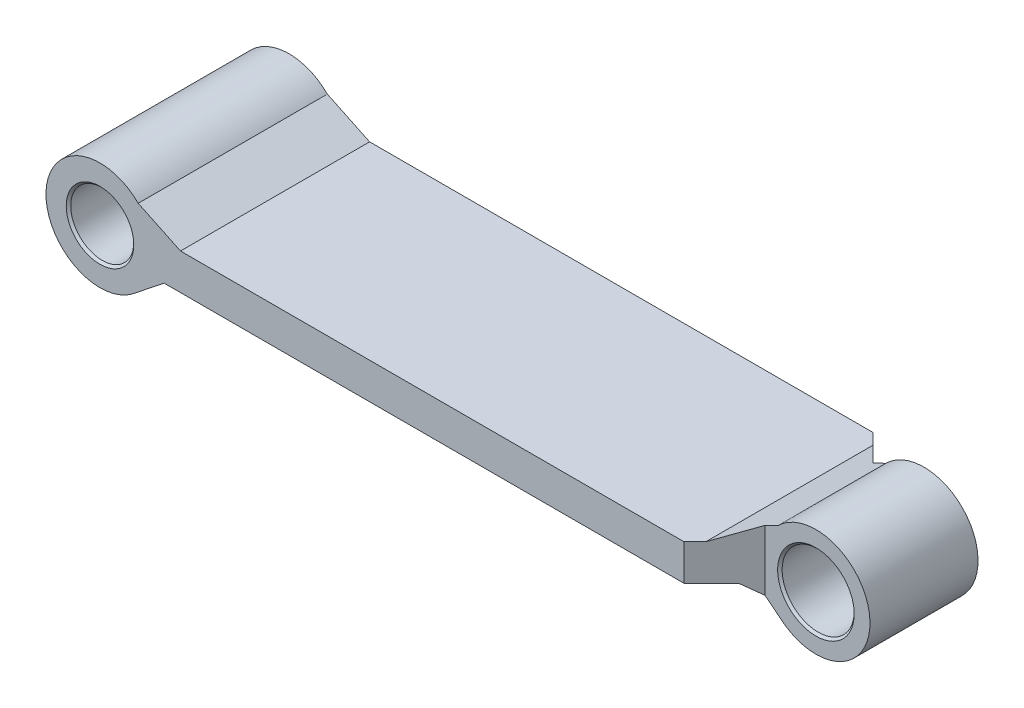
ISO-10303-21;
HEADER;
FILE_DESCRIPTION(('STEP AP214'),'2;1');
FILE_NAME('part.step','',(''),(''),'','','');
FILE_SCHEMA(('AUTOMOTIVE_DESIGN { 1 0 10303 214 1 1 1 1 }'));
ENDSEC;
DATA;
#1=APPLICATION_CONTEXT('core data for automotive mechanical design processes');
#2=APPLICATION_PROTOCOL_DEFINITION('international standard','automotive_design',2000,#1);
#3=PRODUCT_CONTEXT('',#1,'mechanical');
#4=PRODUCT('Part','Part','',(#3));
#5=PRODUCT_RELATED_PRODUCT_CATEGORY('part','',(#4));
#6=PRODUCT_DEFINITION_FORMATION('','',#4);
#7=PRODUCT_DEFINITION_CONTEXT('part definition',#1,'design');
#8=PRODUCT_DEFINITION('design','',#6,#7);
#9=PRODUCT_DEFINITION_SHAPE('','',#8);
#10=(LENGTH_UNIT() NAMED_UNIT(*) SI_UNIT(.MILLI.,.METRE.));
#11=(NAMED_UNIT(*) PLANE_ANGLE_UNIT() SI_UNIT($,.RADIAN.));
#12=(NAMED_UNIT(*) SI_UNIT($,.STERADIAN.) SOLID_ANGLE_UNIT());
#13=UNCERTAINTY_MEASURE_WITH_UNIT(LENGTH_MEASURE(1.E-05),#10,'distance_accuracy_value','');
#14=(GEOMETRIC_REPRESENTATION_CONTEXT(3) GLOBAL_UNCERTAINTY_ASSIGNED_CONTEXT((#13)) GLOBAL_UNIT_ASSIGNED_CONTEXT((#10,
#11,#12)) REPRESENTATION_CONTEXT('',''));
#15=CARTESIAN_POINT('',(0.,0.,0.));
#16=DIRECTION('',(0.,0.,1.));
#17=DIRECTION('',(1.,0.,0.));
#18=AXIS2_PLACEMENT_3D('',#15,#16,#17);
#19=CARTESIAN_POINT('',(-37.5,4.,10.5));
#20=DIRECTION('',(0.,0.,-1.));
#21=DIRECTION('',(-1.,0.,0.));
#22=AXIS2_PLACEMENT_3D('',#19,#20,#21);
#23=PLANE('',#22);
#24=CARTESIAN_POINT('',(-37.5000000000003,2.,10.5));
#25=DIRECTION('',(0.,0.,-1.));
#26=DIRECTION('',(-1.,0.,0.));
#27=AXIS2_PLACEMENT_3D('',#24,#25,#26);
#28=CIRCLE('',#27,3.75000000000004);
#29=CARTESIAN_POINT('',(-41.2500000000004,2.,10.5));
#30=VERTEX_POINT('',#29);
#31=EDGE_CURVE('E192',#30,#30,#28,.T.);
#32=ORIENTED_EDGE('',*,*,#31,.T.);
#33=EDGE_LOOP('',(#32));
#34=FACE_BOUND('',#33,.T.);
#35=CARTESIAN_POINT('',(-37.5000000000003,2.,10.5));
#36=DIRECTION('',(0.,0.,1.));
#37=DIRECTION('',(1.,0.,0.));
#38=AXIS2_PLACEMENT_3D('',#35,#36,#37);
#39=CIRCLE('',#38,6.);
#40=CARTESIAN_POINT('',(-33.257359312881,6.24264068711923,10.5));
#41=VERTEX_POINT('',#40);
#42=CARTESIAN_POINT('',(-33.5880266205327,-2.54933668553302,10.5));
#43=VERTEX_POINT('',#42);
#44=EDGE_CURVE('E276',#41,#43,#39,.T.);
#45=ORIENTED_EDGE('',*,*,#44,.T.);
#46=DIRECTION('',(-0.783018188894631,-0.621998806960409,0.));
#47=VECTOR('',#46,1.);
#48=CARTESIAN_POINT('',(-32.796760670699,-1.92078618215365,10.5));
#49=LINE('',#48,#47);
#50=CARTESIAN_POINT('',(-30.3787326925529,0.,10.5));
#51=VERTEX_POINT('',#50);
#52=EDGE_CURVE('E244',#43,#51,#49,.F.);
#53=ORIENTED_EDGE('',*,*,#52,.T.);
#54=DIRECTION('',(1.,0.,0.));
#55=VECTOR('',#54,1.);
#56=CARTESIAN_POINT('',(-37.5,0.,10.5));
#57=LINE('',#56,#55);
#58=CARTESIAN_POINT('',(27.3431457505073,0.,10.5));
#59=VERTEX_POINT('',#58);
#60=EDGE_CURVE('E157',#51,#59,#57,.T.);
#61=ORIENTED_EDGE('',*,*,#60,.T.);
#62=DIRECTION('',(0.,1.,0.));
#63=VECTOR('',#62,1.);
#64=CARTESIAN_POINT('',(27.3431457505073,4.00000000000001,10.5));
#65=LINE('',#64,#63);
#66=CARTESIAN_POINT('',(27.3431457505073,4.,10.5));
#67=VERTEX_POINT('',#66);
#68=EDGE_CURVE('E149',#59,#67,#65,.T.);
#69=ORIENTED_EDGE('',*,*,#68,.T.);
#70=DIRECTION('',(1.,0.,0.));
#71=VECTOR('',#70,1.);
#72=CARTESIAN_POINT('',(-37.5,4.,10.5));
#73=LINE('',#72,#71);
#74=CARTESIAN_POINT('',(-28.5616367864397,4.,10.5));
#75=VERTEX_POINT('',#74);
#76=EDGE_CURVE('E130',#75,#67,#73,.T.);
#77=ORIENTED_EDGE('',*,*,#76,.F.);
#78=DIRECTION('',(0.902368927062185,-0.430964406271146,0.));
#79=VECTOR('',#78,1.);
#80=CARTESIAN_POINT('',(-35.839874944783,7.47603013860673,10.5));
#81=LINE('',#80,#79);
#82=EDGE_CURVE('E224',#75,#41,#81,.F.);
#83=ORIENTED_EDGE('',*,*,#82,.T.);
#84=EDGE_LOOP('',(#45,#53,#61,#69,#77,#83));
#85=FACE_BOUND('',#84,.T.);
#86=ADVANCED_FACE('F40',(#34,#85),#23,.F.);
#87=CARTESIAN_POINT('',(37.4999999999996,2.,10.5));
#88=DIRECTION('',(0.,0.,-1.));
#89=DIRECTION('',(-1.,0.,0.));
#90=AXIS2_PLACEMENT_3D('',#87,#88,#89);
#91=CYLINDRICAL_SURFACE('',#90,6.);
#92=CARTESIAN_POINT('',(37.4999999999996,2.,5.99999999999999));
#93=DIRECTION('',(0.,0.,1.));
#94=DIRECTION('',(1.,0.,0.));
#95=AXIS2_PLACEMENT_3D('',#92,#93,#94);
#96=CIRCLE('',#95,6.);
#97=CARTESIAN_POINT('',(33.588026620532,-2.54933668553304,5.99999999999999));
#98=VERTEX_POINT('',#97);
#99=CARTESIAN_POINT('',(33.2573593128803,6.24264068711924,5.99999999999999));
#100=VERTEX_POINT('',#99);
#101=EDGE_CURVE('E263',#98,#100,#96,.T.);
#102=ORIENTED_EDGE('',*,*,#101,.F.);
#103=DIRECTION('',(0.,0.,-1.));
#104=VECTOR('',#103,1.);
#105=CARTESIAN_POINT('',(33.588026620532,-2.54933668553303,10.5));
#106=LINE('',#105,#104);
#107=CARTESIAN_POINT('',(33.588026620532,-2.54933668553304,-6.00000000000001));
#108=VERTEX_POINT('',#107);
#109=EDGE_CURVE('E240',#98,#108,#106,.T.);
#110=ORIENTED_EDGE('',*,*,#109,.T.);
#111=CARTESIAN_POINT('',(37.4999999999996,2.,-6.00000000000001));
#112=DIRECTION('',(0.,0.,1.));
#113=DIRECTION('',(1.,0.,0.));
#114=AXIS2_PLACEMENT_3D('',#111,#112,#113);
#115=CIRCLE('',#114,6.);
#116=CARTESIAN_POINT('',(33.2573593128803,6.24264068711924,-6.00000000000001));
#117=VERTEX_POINT('',#116);
#118=EDGE_CURVE('E271',#108,#117,#115,.T.);
#119=ORIENTED_EDGE('',*,*,#118,.T.);
#120=DIRECTION('',(0.,0.,-1.));
#121=VECTOR('',#120,1.);
#122=CARTESIAN_POINT('',(33.2573593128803,6.24264068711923,10.5));
#123=LINE('',#122,#121);
#124=EDGE_CURVE('E205',#117,#100,#123,.F.);
#125=ORIENTED_EDGE('',*,*,#124,.T.);
#126=EDGE_LOOP('',(#102,#110,#119,#125));
#127=FACE_BOUND('',#126,.T.);
#128=ADVANCED_FACE('F265',(#127),#91,.T.);
#129=CARTESIAN_POINT('',(0.,4.,0.));
#130=DIRECTION('',(0.,1.,0.));
#131=DIRECTION('',(0.,0.,1.));
#132=AXIS2_PLACEMENT_3D('',#129,#130,#131);
#133=PLANE('',#132);
#134=DIRECTION('',(0.707106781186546,0.,-0.707106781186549));
#135=VECTOR('',#134,1.);
#136=CARTESIAN_POINT('',(18.9215728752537,4.,18.9215728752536));
#137=LINE('',#136,#135);
#138=CARTESIAN_POINT('',(28.561636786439,4.,9.28150896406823));
#139=VERTEX_POINT('',#138);
#140=EDGE_CURVE('E134',#67,#139,#137,.T.);
#141=ORIENTED_EDGE('',*,*,#140,.T.);
#142=DIRECTION('',(0.,0.,-1.));
#143=VECTOR('',#142,1.);
#144=CARTESIAN_POINT('',(28.561636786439,4.,0.));
#145=LINE('',#144,#143);
#146=CARTESIAN_POINT('',(28.5616367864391,4.,-9.28150896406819));
#147=VERTEX_POINT('',#146);
#148=EDGE_CURVE('E202',#139,#147,#145,.T.);
#149=ORIENTED_EDGE('',*,*,#148,.T.);
#150=DIRECTION('',(-0.707106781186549,0.,-0.707106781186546));
#151=VECTOR('',#150,1.);
#152=CARTESIAN_POINT('',(18.9215728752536,4.,-18.9215728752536));
#153=LINE('',#152,#151);
#154=CARTESIAN_POINT('',(27.3431457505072,4.,-10.5));
#155=VERTEX_POINT('',#154);
#156=EDGE_CURVE('E153',#147,#155,#153,.T.);
#157=ORIENTED_EDGE('',*,*,#156,.T.);
#158=DIRECTION('',(1.,0.,0.));
#159=VECTOR('',#158,1.);
#160=CARTESIAN_POINT('',(-37.5,4.,-10.5));
#161=LINE('',#160,#159);
#162=CARTESIAN_POINT('',(-28.5616367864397,4.,-10.5));
#163=VERTEX_POINT('',#162);
#164=EDGE_CURVE('E142',#163,#155,#161,.T.);
#165=ORIENTED_EDGE('',*,*,#164,.F.);
#166=DIRECTION('',(0.,0.,1.));
#167=VECTOR('',#166,1.);
#168=CARTESIAN_POINT('',(-28.5616367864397,4.,0.));
#169=LINE('',#168,#167);
#170=EDGE_CURVE('E138',#163,#75,#169,.T.);
#171=ORIENTED_EDGE('',*,*,#170,.T.);
#172=ORIENTED_EDGE('',*,*,#76,.T.);
#173=EDGE_LOOP('',(#141,#149,#157,#165,#171,#172));
#174=FACE_BOUND('',#173,.T.);
#175=ADVANCED_FACE('F132',(#174),#133,.T.);
#176=CARTESIAN_POINT('',(0.,0.,0.));
#177=DIRECTION('',(0.,1.,0.));
#178=DIRECTION('',(0.,0.,1.));
#179=AXIS2_PLACEMENT_3D('',#176,#177,#178);
#180=PLANE('',#179);
#181=ORIENTED_EDGE('',*,*,#60,.F.);
#182=DIRECTION('',(0.,0.,-1.));
#183=VECTOR('',#182,1.);
#184=CARTESIAN_POINT('',(-30.3787326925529,0.,-10.5));
#185=LINE('',#184,#183);
#186=CARTESIAN_POINT('',(-30.3787326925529,0.,-10.5));
#187=VERTEX_POINT('',#186);
#188=EDGE_CURVE('E237',#51,#187,#185,.T.);
#189=ORIENTED_EDGE('',*,*,#188,.T.);
#190=DIRECTION('',(1.,0.,0.));
#191=VECTOR('',#190,1.);
#192=CARTESIAN_POINT('',(-37.5,0.,-10.5));
#193=LINE('',#192,#191);
#194=CARTESIAN_POINT('',(27.3431457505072,0.,-10.5));
#195=VERTEX_POINT('',#194);
#196=EDGE_CURVE('E143',#187,#195,#193,.T.);
#197=ORIENTED_EDGE('',*,*,#196,.T.);
#198=DIRECTION('',(0.707106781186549,0.,0.707106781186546));
#199=VECTOR('',#198,1.);
#200=CARTESIAN_POINT('',(31.8431457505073,0.,-5.99999999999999));
#201=LINE('',#200,#199);
#202=CARTESIAN_POINT('',(30.3787326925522,0.,-7.46441305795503));
#203=VERTEX_POINT('',#202);
#204=EDGE_CURVE('E161',#195,#203,#201,.T.);
#205=ORIENTED_EDGE('',*,*,#204,.T.);
#206=DIRECTION('',(0.,0.,1.));
#207=VECTOR('',#206,1.);
#208=CARTESIAN_POINT('',(30.3787326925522,0.,5.99999999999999));
#209=LINE('',#208,#207);
#210=CARTESIAN_POINT('',(30.3787326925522,0.,7.46441305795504));
#211=VERTEX_POINT('',#210);
#212=EDGE_CURVE('E234',#203,#211,#209,.T.);
#213=ORIENTED_EDGE('',*,*,#212,.T.);
#214=DIRECTION('',(-0.707106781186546,0.,0.707106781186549));
#215=VECTOR('',#214,1.);
#216=CARTESIAN_POINT('',(27.3431457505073,0.,10.5));
#217=LINE('',#216,#215);
#218=EDGE_CURVE('E169',#211,#59,#217,.T.);
#219=ORIENTED_EDGE('',*,*,#218,.T.);
#220=EDGE_LOOP('',(#181,#189,#197,#205,#213,#219));
#221=FACE_BOUND('',#220,.T.);
#222=ADVANCED_FACE('F297',(#221),#180,.F.);
#223=CARTESIAN_POINT('',(-37.5,4.,-10.5));
#224=DIRECTION('',(0.,0.,-1.));
#225=DIRECTION('',(-1.,0.,0.));
#226=AXIS2_PLACEMENT_3D('',#223,#224,#225);
#227=PLANE('',#226);
#228=CARTESIAN_POINT('',(-37.5000000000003,2.,-10.5));
#229=DIRECTION('',(0.,0.,-1.));
#230=DIRECTION('',(-1.,0.,0.));
#231=AXIS2_PLACEMENT_3D('',#228,#229,#230);
#232=CIRCLE('',#231,3.74999999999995);
#233=CARTESIAN_POINT('',(-41.2500000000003,2.,-10.5));
#234=VERTEX_POINT('',#233);
#235=EDGE_CURVE('E196',#234,#234,#232,.F.);
#236=ORIENTED_EDGE('',*,*,#235,.T.);
#237=EDGE_LOOP('',(#236));
#238=FACE_BOUND('',#237,.T.);
#239=CARTESIAN_POINT('',(-37.5000000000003,2.,-10.5));
#240=DIRECTION('',(0.,0.,1.));
#241=DIRECTION('',(1.,0.,0.));
#242=AXIS2_PLACEMENT_3D('',#239,#240,#241);
#243=CIRCLE('',#242,6.);
#244=CARTESIAN_POINT('',(-33.257359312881,6.24264068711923,-10.5));
#245=VERTEX_POINT('',#244);
#246=CARTESIAN_POINT('',(-33.5880266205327,-2.54933668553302,-10.5));
#247=VERTEX_POINT('',#246);
#248=EDGE_CURVE('E270',#245,#247,#243,.T.);
#249=ORIENTED_EDGE('',*,*,#248,.F.);
#250=DIRECTION('',(-0.902368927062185,0.430964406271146,0.));
#251=VECTOR('',#250,1.);
#252=CARTESIAN_POINT('',(-28.5616367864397,4.,-10.5));
#253=LINE('',#252,#251);
#254=EDGE_CURVE('E227',#245,#163,#253,.F.);
#255=ORIENTED_EDGE('',*,*,#254,.T.);
#256=ORIENTED_EDGE('',*,*,#164,.T.);
#257=DIRECTION('',(0.,-1.,0.));
#258=VECTOR('',#257,1.);
#259=CARTESIAN_POINT('',(27.3431457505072,0.,-10.5));
#260=LINE('',#259,#258);
#261=EDGE_CURVE('E292',#155,#195,#260,.T.);
#262=ORIENTED_EDGE('',*,*,#261,.T.);
#263=ORIENTED_EDGE('',*,*,#196,.F.);
#264=DIRECTION('',(0.783018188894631,0.621998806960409,0.));
#265=VECTOR('',#264,1.);
#266=CARTESIAN_POINT('',(-33.5880266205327,-2.54933668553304,-10.5));
#267=LINE('',#266,#265);
#268=EDGE_CURVE('E247',#187,#247,#267,.F.);
#269=ORIENTED_EDGE('',*,*,#268,.T.);
#270=EDGE_LOOP('',(#249,#255,#256,#262,#263,#269));
#271=FACE_BOUND('',#270,.T.);
#272=ADVANCED_FACE('F307',(#238,#271),#227,.T.);
#273=CARTESIAN_POINT('',(-37.5000000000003,2.,10.5));
#274=DIRECTION('',(0.,0.,-1.));
#275=DIRECTION('',(-1.,0.,0.));
#276=AXIS2_PLACEMENT_3D('',#273,#274,#275);
#277=CYLINDRICAL_SURFACE('',#276,6.);
#278=ORIENTED_EDGE('',*,*,#248,.T.);
#279=DIRECTION('',(0.,0.,-1.));
#280=VECTOR('',#279,1.);
#281=CARTESIAN_POINT('',(-33.5880266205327,-2.54933668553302,10.5));
#282=LINE('',#281,#280);
#283=EDGE_CURVE('E230',#247,#43,#282,.F.);
#284=ORIENTED_EDGE('',*,*,#283,.T.);
#285=ORIENTED_EDGE('',*,*,#44,.F.);
#286=DIRECTION('',(0.,0.,-1.));
#287=VECTOR('',#286,1.);
#288=CARTESIAN_POINT('',(-33.257359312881,6.24264068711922,10.5));
#289=LINE('',#288,#287);
#290=EDGE_CURVE('E209',#41,#245,#289,.T.);
#291=ORIENTED_EDGE('',*,*,#290,.T.);
#292=EDGE_LOOP('',(#278,#284,#285,#291));
#293=FACE_BOUND('',#292,.T.);
#294=ADVANCED_FACE('F330',(#293),#277,.T.);
#295=CARTESIAN_POINT('',(-37.5000000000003,2.,-10.5));
#296=DIRECTION('',(0.,0.,1.));
#297=DIRECTION('',(1.,0.,0.));
#298=AXIS2_PLACEMENT_3D('',#295,#296,#297);
#299=CYLINDRICAL_SURFACE('',#298,3.5);
#300=CARTESIAN_POINT('',(-37.5000000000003,2.,10.2499999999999));
#301=DIRECTION('',(0.,0.,-1.));
#302=DIRECTION('',(-1.,0.,0.));
#303=AXIS2_PLACEMENT_3D('',#300,#301,#302);
#304=CIRCLE('',#303,3.5);
#305=CARTESIAN_POINT('',(-34.0000000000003,2.,10.25));
#306=VERTEX_POINT('',#305);
#307=EDGE_CURVE('E188',#306,#306,#304,.F.);
#308=CARTESIAN_POINT('',(-37.5000000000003,2.,-10.2500000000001));
#309=DIRECTION('',(0.,0.,-1.));
#310=DIRECTION('',(-1.,0.,0.));
#311=AXIS2_PLACEMENT_3D('',#308,#309,#310);
#312=CIRCLE('',#311,3.5);
#313=CARTESIAN_POINT('',(-34.0000000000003,2.,-10.2500000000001));
#314=VERTEX_POINT('',#313);
#315=EDGE_CURVE('E184',#314,#314,#312,.T.);
#316=CARTESIAN_POINT('',(-34.0000000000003,2.,10.25));
#317=CARTESIAN_POINT('',(-34.0000000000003,2.,10.0364583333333));
#318=CARTESIAN_POINT('',(-34.0000000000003,2.,9.82291666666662));
#319=CARTESIAN_POINT('',(-34.0000000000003,2.,9.39583333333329));
#320=CARTESIAN_POINT('',(-34.0000000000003,2.,9.18229166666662));
#321=CARTESIAN_POINT('',(-34.0000000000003,2.,8.75520833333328));
#322=CARTESIAN_POINT('',(-34.0000000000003,2.,8.54166666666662));
#323=CARTESIAN_POINT('',(-34.0000000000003,2.,8.11458333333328));
#324=CARTESIAN_POINT('',(-34.0000000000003,2.,7.90104166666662));
#325=CARTESIAN_POINT('',(-34.0000000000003,2.,7.47395833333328));
#326=CARTESIAN_POINT('',(-34.0000000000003,2.,7.26041666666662));
#327=CARTESIAN_POINT('',(-34.0000000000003,2.,6.83333333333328));
#328=CARTESIAN_POINT('',(-34.0000000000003,2.,6.61979166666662));
#329=CARTESIAN_POINT('',(-34.0000000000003,2.,6.19270833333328));
#330=CARTESIAN_POINT('',(-34.0000000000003,2.,5.97916666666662));
#331=CARTESIAN_POINT('',(-34.0000000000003,2.,5.55208333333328));
#332=CARTESIAN_POINT('',(-34.0000000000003,2.,5.33854166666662));
#333=CARTESIAN_POINT('',(-34.0000000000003,2.,4.91145833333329));
#334=CARTESIAN_POINT('',(-34.0000000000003,2.,4.69791666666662));
#335=CARTESIAN_POINT('',(-34.0000000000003,2.,4.27083333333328));
#336=CARTESIAN_POINT('',(-34.0000000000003,2.,4.05729166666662));
#337=CARTESIAN_POINT('',(-34.0000000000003,2.,3.63020833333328));
#338=CARTESIAN_POINT('',(-34.0000000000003,2.,3.41666666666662));
#339=CARTESIAN_POINT('',(-34.0000000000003,2.,2.98958333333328));
#340=CARTESIAN_POINT('',(-34.0000000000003,2.,2.77604166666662));
#341=CARTESIAN_POINT('',(-34.0000000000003,2.,2.34895833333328));
#342=CARTESIAN_POINT('',(-34.0000000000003,2.,2.13541666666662));
#343=CARTESIAN_POINT('',(-34.0000000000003,2.,1.70833333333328));
#344=CARTESIAN_POINT('',(-34.0000000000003,2.,1.49479166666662));
#345=CARTESIAN_POINT('',(-34.0000000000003,2.,1.06770833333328));
#346=CARTESIAN_POINT('',(-34.0000000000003,2.,0.854166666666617));
#347=CARTESIAN_POINT('',(-34.0000000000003,2.,0.427083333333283));
#348=CARTESIAN_POINT('',(-34.0000000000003,2.,0.213541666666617));
#349=CARTESIAN_POINT('',(-34.0000000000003,2.,-0.213541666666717));
#350=CARTESIAN_POINT('',(-34.0000000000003,2.,-0.427083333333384));
#351=CARTESIAN_POINT('',(-34.0000000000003,2.,-0.854166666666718));
#352=CARTESIAN_POINT('',(-34.0000000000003,2.,-1.06770833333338));
#353=CARTESIAN_POINT('',(-34.0000000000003,2.,-1.49479166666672));
#354=CARTESIAN_POINT('',(-34.0000000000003,2.,-1.70833333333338));
#355=CARTESIAN_POINT('',(-34.0000000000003,2.,-2.13541666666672));
#356=CARTESIAN_POINT('',(-34.0000000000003,2.,-2.34895833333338));
#357=CARTESIAN_POINT('',(-34.0000000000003,2.,-2.77604166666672));
#358=CARTESIAN_POINT('',(-34.0000000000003,2.,-2.98958333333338));
#359=CARTESIAN_POINT('',(-34.0000000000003,2.,-3.41666666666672));
#360=CARTESIAN_POINT('',(-34.0000000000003,2.,-3.63020833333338));
#361=CARTESIAN_POINT('',(-34.0000000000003,2.,-4.05729166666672));
#362=CARTESIAN_POINT('',(-34.0000000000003,2.,-4.27083333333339));
#363=CARTESIAN_POINT('',(-34.0000000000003,2.,-4.69791666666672));
#364=CARTESIAN_POINT('',(-34.0000000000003,2.,-4.91145833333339));
#365=CARTESIAN_POINT('',(-34.0000000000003,2.,-5.33854166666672));
#366=CARTESIAN_POINT('',(-34.0000000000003,2.,-5.55208333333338));
#367=CARTESIAN_POINT('',(-34.0000000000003,2.,-5.97916666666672));
#368=CARTESIAN_POINT('',(-34.0000000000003,2.,-6.19270833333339));
#369=CARTESIAN_POINT('',(-34.0000000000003,2.,-6.61979166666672));
#370=CARTESIAN_POINT('',(-34.0000000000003,2.,-6.83333333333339));
#371=CARTESIAN_POINT('',(-34.0000000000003,2.,-7.26041666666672));
#372=CARTESIAN_POINT('',(-34.0000000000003,2.,-7.47395833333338));
#373=CARTESIAN_POINT('',(-34.0000000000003,2.,-7.90104166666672));
#374=CARTESIAN_POINT('',(-34.0000000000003,2.,-8.11458333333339));
#375=CARTESIAN_POINT('',(-34.0000000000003,2.,-8.54166666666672));
#376=CARTESIAN_POINT('',(-34.0000000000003,2.,-8.75520833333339));
#377=CARTESIAN_POINT('',(-34.0000000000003,2.,-9.18229166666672));
#378=CARTESIAN_POINT('',(-34.0000000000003,2.,-9.39583333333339));
#379=CARTESIAN_POINT('',(-34.0000000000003,2.,-9.82291666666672));
#380=CARTESIAN_POINT('',(-34.0000000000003,2.,-10.0364583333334));
#381=CARTESIAN_POINT('',(-34.0000000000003,2.,-10.2500000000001));
#382=B_SPLINE_CURVE_WITH_KNOTS('',3,(#316,#317,#318,#319,#320,#321,#322,#323,#324,#325,#326,
#327,#328,#329,#330,#331,#332,#333,#334,#335,#336,#337,#338,#339,#340,#341,#342,#343,#344,#345,
#346,#347,#348,#349,#350,#351,#352,#353,#354,#355,#356,#357,#358,#359,#360,#361,#362,#363,#364,
#365,#366,#367,#368,#369,#370,#371,#372,#373,#374,#375,#376,#377,#378,#379,#380,#381),
.UNSPECIFIED.,.F.,.F.,(4,2,2,2,2,2,2,2,2,2,2,2,2,2,2,2,2,2,2,2,2,2,2,2,2,2,2,2,2,2,2,2,4),(0.,
0.640624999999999,1.28125,1.921875,2.5625,3.203125,3.84375,4.484375,5.125,5.765625,6.40625,
7.046875,7.6875,8.328125,8.96875,9.609375,10.25,10.890625,11.53125,12.171875,12.8125,13.453125,
14.09375,14.734375,15.375,16.015625,16.65625,17.296875,17.9375,18.578125,19.21875,19.859375,
20.5),.UNSPECIFIED.);
#383=EDGE_CURVE('BSEAM319',#306,#314,#382,.T.);
#384=ORIENTED_EDGE('',*,*,#307,.T.);
#385=ORIENTED_EDGE('',*,*,#315,.T.);
#386=ORIENTED_EDGE('',*,*,#383,.T.);
#387=ORIENTED_EDGE('',*,*,#383,.F.);
#388=EDGE_LOOP('',(#384,#386,#385,#387));
#389=FACE_BOUND('',#388,.T.);
#390=ADVANCED_FACE('F319',(#389),#299,.F.);
#391=CARTESIAN_POINT('',(31.8431457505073,-4.,-6.00000000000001));
#392=DIRECTION('',(0.,0.,1.));
#393=DIRECTION('',(1.,0.,0.));
#394=AXIS2_PLACEMENT_3D('',#391,#392,#393);
#395=PLANE('',#394);
#396=CARTESIAN_POINT('',(37.4999999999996,2.,-6.00000000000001));
#397=DIRECTION('',(0.,0.,1.));
#398=DIRECTION('',(1.,0.,0.));
#399=AXIS2_PLACEMENT_3D('',#396,#397,#398);
#400=CIRCLE('',#399,4.25000000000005);
#401=CARTESIAN_POINT('',(41.7499999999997,2.,-6.00000000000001));
#402=VERTEX_POINT('',#401);
#403=EDGE_CURVE('E180',#402,#402,#400,.T.);
#404=ORIENTED_EDGE('',*,*,#403,.T.);
#405=EDGE_LOOP('',(#404));
#406=FACE_BOUND('',#405,.T.);
#407=ORIENTED_EDGE('',*,*,#118,.F.);
#408=DIRECTION('',(-0.783018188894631,0.621998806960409,0.));
#409=VECTOR('',#408,1.);
#410=CARTESIAN_POINT('',(33.2247354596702,-2.26075249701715,-6.00000000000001));
#411=LINE('',#410,#409);
#412=CARTESIAN_POINT('',(31.8431457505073,-1.16327205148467,-6.00000000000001));
#413=VERTEX_POINT('',#412);
#414=EDGE_CURVE('E250',#108,#413,#411,.T.);
#415=ORIENTED_EDGE('',*,*,#414,.T.);
#416=DIRECTION('',(0.,1.,0.));
#417=VECTOR('',#416,1.);
#418=CARTESIAN_POINT('',(31.8431457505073,-4.,-6.00000000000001));
#419=LINE('',#418,#417);
#420=CARTESIAN_POINT('',(31.8431457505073,5.56722324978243,-6.00000000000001));
#421=VERTEX_POINT('',#420);
#422=EDGE_CURVE('E63',#413,#421,#419,.T.);
#423=ORIENTED_EDGE('',*,*,#422,.T.);
#424=DIRECTION('',(0.902368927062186,0.430964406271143,0.));
#425=VECTOR('',#424,1.);
#426=CARTESIAN_POINT('',(28.1225589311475,3.79029981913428,-6.00000000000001));
#427=LINE('',#426,#425);
#428=EDGE_CURVE('E215',#421,#117,#427,.T.);
#429=ORIENTED_EDGE('',*,*,#428,.T.);
#430=EDGE_LOOP('',(#407,#415,#423,#429));
#431=FACE_BOUND('',#430,.T.);
#432=ADVANCED_FACE('F314',(#406,#431),#395,.F.);
#433=CARTESIAN_POINT('',(0.,-4.,5.99999999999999));
#434=DIRECTION('',(0.,0.,1.));
#435=DIRECTION('',(1.,0.,0.));
#436=AXIS2_PLACEMENT_3D('',#433,#434,#435);
#437=PLANE('',#436);
#438=CARTESIAN_POINT('',(37.4999999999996,2.,5.99999999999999));
#439=DIRECTION('',(0.,0.,1.));
#440=DIRECTION('',(1.,0.,0.));
#441=AXIS2_PLACEMENT_3D('',#438,#439,#440);
#442=CIRCLE('',#441,4.24999999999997);
#443=CARTESIAN_POINT('',(41.7499999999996,2.,5.99999999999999));
#444=VERTEX_POINT('',#443);
#445=EDGE_CURVE('E160',#444,#444,#442,.F.);
#446=ORIENTED_EDGE('',*,*,#445,.T.);
#447=EDGE_LOOP('',(#446));
#448=FACE_BOUND('',#447,.T.);
#449=DIRECTION('',(0.,1.,0.));
#450=VECTOR('',#449,1.);
#451=CARTESIAN_POINT('',(31.8431457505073,-4.,5.99999999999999));
#452=LINE('',#451,#450);
#453=CARTESIAN_POINT('',(31.8431457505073,-1.16327205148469,5.99999999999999));
#454=VERTEX_POINT('',#453);
#455=CARTESIAN_POINT('',(31.8431457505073,5.56722324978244,5.99999999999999));
#456=VERTEX_POINT('',#455);
#457=EDGE_CURVE('E55',#454,#456,#452,.T.);
#458=ORIENTED_EDGE('',*,*,#457,.F.);
#459=DIRECTION('',(0.783018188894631,-0.621998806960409,0.));
#460=VECTOR('',#459,1.);
#461=CARTESIAN_POINT('',(33.588026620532,-2.54933668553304,5.99999999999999));
#462=LINE('',#461,#460);
#463=EDGE_CURVE('E11',#454,#98,#462,.T.);
#464=ORIENTED_EDGE('',*,*,#463,.T.);
#465=ORIENTED_EDGE('',*,*,#101,.T.);
#466=DIRECTION('',(-0.902368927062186,-0.430964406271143,0.));
#467=VECTOR('',#466,1.);
#468=CARTESIAN_POINT('',(28.5616367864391,4.,5.99999999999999));
#469=LINE('',#468,#467);
#470=EDGE_CURVE('E219',#100,#456,#469,.T.);
#471=ORIENTED_EDGE('',*,*,#470,.T.);
#472=EDGE_LOOP('',(#458,#464,#465,#471));
#473=FACE_BOUND('',#472,.T.);
#474=ADVANCED_FACE('F262',(#448,#473),#437,.T.);
#475=CARTESIAN_POINT('',(37.4999999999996,2.,-10.5));
#476=DIRECTION('',(0.,0.,1.));
#477=DIRECTION('',(1.,0.,0.));
#478=AXIS2_PLACEMENT_3D('',#475,#476,#477);
#479=CYLINDRICAL_SURFACE('',#478,4.);
#480=CARTESIAN_POINT('',(37.4999999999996,2.,5.75000000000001));
#481=DIRECTION('',(0.,0.,1.));
#482=DIRECTION('',(1.,0.,0.));
#483=AXIS2_PLACEMENT_3D('',#480,#481,#482);
#484=CIRCLE('',#483,4.);
#485=CARTESIAN_POINT('',(41.4999999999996,2.,5.75000000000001));
#486=VERTEX_POINT('',#485);
#487=EDGE_CURVE('E176',#486,#486,#484,.T.);
#488=CARTESIAN_POINT('',(37.4999999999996,2.,-5.74999999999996));
#489=DIRECTION('',(0.,0.,1.));
#490=DIRECTION('',(1.,0.,0.));
#491=AXIS2_PLACEMENT_3D('',#488,#489,#490);
#492=CIRCLE('',#491,4.);
#493=CARTESIAN_POINT('',(41.4999999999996,2.,-5.74999999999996));
#494=VERTEX_POINT('',#493);
#495=EDGE_CURVE('E166',#494,#494,#492,.F.);
#496=CARTESIAN_POINT('',(41.4999999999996,2.,5.75000000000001));
#497=CARTESIAN_POINT('',(41.4999999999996,2.,5.63020833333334));
#498=CARTESIAN_POINT('',(41.4999999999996,2.,5.51041666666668));
#499=CARTESIAN_POINT('',(41.4999999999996,2.,5.27083333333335));
#500=CARTESIAN_POINT('',(41.4999999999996,2.,5.15104166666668));
#501=CARTESIAN_POINT('',(41.4999999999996,2.,4.91145833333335));
#502=CARTESIAN_POINT('',(41.4999999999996,2.,4.79166666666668));
#503=CARTESIAN_POINT('',(41.4999999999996,2.,4.55208333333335));
#504=CARTESIAN_POINT('',(41.4999999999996,2.,4.43229166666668));
#505=CARTESIAN_POINT('',(41.4999999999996,2.,4.19270833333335));
#506=CARTESIAN_POINT('',(41.4999999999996,2.,4.07291666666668));
#507=CARTESIAN_POINT('',(41.4999999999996,2.,3.83333333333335));
#508=CARTESIAN_POINT('',(41.4999999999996,2.,3.71354166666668));
#509=CARTESIAN_POINT('',(41.4999999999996,2.,3.47395833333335));
#510=CARTESIAN_POINT('',(41.4999999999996,2.,3.35416666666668));
#511=CARTESIAN_POINT('',(41.4999999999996,2.,3.11458333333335));
#512=CARTESIAN_POINT('',(41.4999999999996,2.,2.99479166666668));
#513=CARTESIAN_POINT('',(41.4999999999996,2.,2.75520833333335));
#514=CARTESIAN_POINT('',(41.4999999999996,2.,2.63541666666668));
#515=CARTESIAN_POINT('',(41.4999999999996,2.,2.39583333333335));
#516=CARTESIAN_POINT('',(41.4999999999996,2.,2.27604166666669));
#517=CARTESIAN_POINT('',(41.4999999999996,2.,2.03645833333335));
#518=CARTESIAN_POINT('',(41.4999999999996,2.,1.91666666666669));
#519=CARTESIAN_POINT('',(41.4999999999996,2.,1.67708333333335));
#520=CARTESIAN_POINT('',(41.4999999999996,2.,1.55729166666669));
#521=CARTESIAN_POINT('',(41.4999999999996,2.,1.31770833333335));
#522=CARTESIAN_POINT('',(41.4999999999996,2.,1.19791666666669));
#523=CARTESIAN_POINT('',(41.4999999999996,2.,0.958333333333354));
#524=CARTESIAN_POINT('',(41.4999999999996,2.,0.838541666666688));
#525=CARTESIAN_POINT('',(41.4999999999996,2.,0.598958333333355));
#526=CARTESIAN_POINT('',(41.4999999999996,2.,0.479166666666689));
#527=CARTESIAN_POINT('',(41.4999999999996,2.,0.239583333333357));
#528=CARTESIAN_POINT('',(41.4999999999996,2.,0.11979166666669));
#529=CARTESIAN_POINT('',(41.4999999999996,2.,-0.119791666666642));
#530=CARTESIAN_POINT('',(41.4999999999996,2.,-0.239583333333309));
#531=CARTESIAN_POINT('',(41.4999999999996,2.,-0.479166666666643));
#532=CARTESIAN_POINT('',(41.4999999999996,2.,-0.59895833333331));
#533=CARTESIAN_POINT('',(41.4999999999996,2.,-0.838541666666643));
#534=CARTESIAN_POINT('',(41.4999999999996,2.,-0.958333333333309));
#535=CARTESIAN_POINT('',(41.4999999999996,2.,-1.19791666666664));
#536=CARTESIAN_POINT('',(41.4999999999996,2.,-1.31770833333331));
#537=CARTESIAN_POINT('',(41.4999999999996,2.,-1.55729166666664));
#538=CARTESIAN_POINT('',(41.4999999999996,2.,-1.67708333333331));
#539=CARTESIAN_POINT('',(41.4999999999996,2.,-1.91666666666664));
#540=CARTESIAN_POINT('',(41.4999999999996,2.,-2.03645833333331));
#541=CARTESIAN_POINT('',(41.4999999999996,2.,-2.27604166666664));
#542=CARTESIAN_POINT('',(41.4999999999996,2.,-2.39583333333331));
#543=CARTESIAN_POINT('',(41.4999999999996,2.,-2.63541666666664));
#544=CARTESIAN_POINT('',(41.4999999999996,2.,-2.7552083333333));
#545=CARTESIAN_POINT('',(41.4999999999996,2.,-2.99479166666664));
#546=CARTESIAN_POINT('',(41.4999999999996,2.,-3.1145833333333));
#547=CARTESIAN_POINT('',(41.4999999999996,2.,-3.35416666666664));
#548=CARTESIAN_POINT('',(41.4999999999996,2.,-3.4739583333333));
#549=CARTESIAN_POINT('',(41.4999999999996,2.,-3.71354166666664));
#550=CARTESIAN_POINT('',(41.4999999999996,2.,-3.8333333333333));
#551=CARTESIAN_POINT('',(41.4999999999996,2.,-4.07291666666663));
#552=CARTESIAN_POINT('',(41.4999999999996,2.,-4.1927083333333));
#553=CARTESIAN_POINT('',(41.4999999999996,2.,-4.43229166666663));
#554=CARTESIAN_POINT('',(41.4999999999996,2.,-4.5520833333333));
#555=CARTESIAN_POINT('',(41.4999999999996,2.,-4.79166666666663));
#556=CARTESIAN_POINT('',(41.4999999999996,2.,-4.9114583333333));
#557=CARTESIAN_POINT('',(41.4999999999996,2.,-5.15104166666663));
#558=CARTESIAN_POINT('',(41.4999999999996,2.,-5.2708333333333));
#559=CARTESIAN_POINT('',(41.4999999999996,2.,-5.51041666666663));
#560=CARTESIAN_POINT('',(41.4999999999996,2.,-5.6302083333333));
#561=CARTESIAN_POINT('',(41.4999999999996,2.,-5.74999999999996));
#562=B_SPLINE_CURVE_WITH_KNOTS('',3,(#496,#497,#498,#499,#500,#501,#502,#503,#504,#505,#506,
#507,#508,#509,#510,#511,#512,#513,#514,#515,#516,#517,#518,#519,#520,#521,#522,#523,#524,#525,
#526,#527,#528,#529,#530,#531,#532,#533,#534,#535,#536,#537,#538,#539,#540,#541,#542,#543,#544,
#545,#546,#547,#548,#549,#550,#551,#552,#553,#554,#555,#556,#557,#558,#559,#560,#561),
.UNSPECIFIED.,.F.,.F.,(4,2,2,2,2,2,2,2,2,2,2,2,2,2,2,2,2,2,2,2,2,2,2,2,2,2,2,2,2,2,2,2,4),(0.,
0.359374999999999,0.718749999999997,1.078125,1.4375,1.79687499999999,2.15624999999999,
2.51562499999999,2.87499999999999,3.23437499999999,3.59374999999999,3.95312499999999,
4.31249999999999,4.67187499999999,5.03124999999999,5.39062499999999,5.74999999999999,
6.10937499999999,6.46874999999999,6.82812499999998,7.18749999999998,7.54687499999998,
7.90624999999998,8.26562499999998,8.62499999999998,8.98437499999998,9.34374999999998,
9.70312499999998,10.0625,10.421875,10.78125,11.140625,11.5),.UNSPECIFIED.);
#563=EDGE_CURVE('BSEAM326',#486,#494,#562,.T.);
#564=ORIENTED_EDGE('',*,*,#487,.T.);
#565=ORIENTED_EDGE('',*,*,#495,.T.);
#566=ORIENTED_EDGE('',*,*,#563,.T.);
#567=ORIENTED_EDGE('',*,*,#563,.F.);
#568=EDGE_LOOP('',(#564,#566,#565,#567));
#569=FACE_BOUND('',#568,.T.);
#570=ADVANCED_FACE('F326',(#569),#479,.F.);
#571=CARTESIAN_POINT('',(31.8431457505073,-4.,-5.99999999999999));
#572=DIRECTION('',(0.707106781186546,0.,-0.707106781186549));
#573=DIRECTION('',(0.,-1.,0.));
#574=AXIS2_PLACEMENT_3D('',#571,#572,#573);
#575=PLANE('',#574);
#576=ORIENTED_EDGE('',*,*,#204,.F.);
#577=ORIENTED_EDGE('',*,*,#261,.F.);
#578=ORIENTED_EDGE('',*,*,#156,.F.);
#579=DIRECTION('',(0.6699358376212,0.319956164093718,0.669935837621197));
#580=VECTOR('',#579,1.);
#581=CARTESIAN_POINT('',(37.4398554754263,8.2401684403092,-0.403290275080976));
#582=LINE('',#581,#580);
#583=EDGE_CURVE('E212',#147,#421,#582,.T.);
#584=ORIENTED_EDGE('',*,*,#583,.T.);
#585=ORIENTED_EDGE('',*,*,#422,.F.);
#586=DIRECTION('',(-0.616508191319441,0.489729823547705,-0.616508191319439));
#587=VECTOR('',#586,1.);
#588=CARTESIAN_POINT('',(39.1961869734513,-7.00423837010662,1.35304122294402));
#589=LINE('',#588,#587);
#590=EDGE_CURVE('E253',#413,#203,#589,.T.);
#591=ORIENTED_EDGE('',*,*,#590,.T.);
#592=EDGE_LOOP('',(#576,#577,#578,#584,#585,#591));
#593=FACE_BOUND('',#592,.T.);
#594=ADVANCED_FACE('F301',(#593),#575,.T.);
#595=CARTESIAN_POINT('',(27.3431457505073,4.,10.5));
#596=DIRECTION('',(0.707106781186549,0.,0.707106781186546));
#597=DIRECTION('',(0.,-1.,0.));
#598=AXIS2_PLACEMENT_3D('',#595,#596,#597);
#599=PLANE('',#598);
#600=ORIENTED_EDGE('',*,*,#218,.F.);
#601=DIRECTION('',(0.616508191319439,-0.489729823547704,-0.616508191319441));
#602=VECTOR('',#601,1.);
#603=CARTESIAN_POINT('',(31.214457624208,-0.663866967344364,6.62868812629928));
#604=LINE('',#603,#602);
#605=EDGE_CURVE('E49',#211,#454,#604,.T.);
#606=ORIENTED_EDGE('',*,*,#605,.T.);
#607=ORIENTED_EDGE('',*,*,#457,.T.);
#608=DIRECTION('',(-0.669935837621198,-0.319956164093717,0.6699358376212));
#609=VECTOR('',#608,1.);
#610=CARTESIAN_POINT('',(28.0147609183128,3.7388163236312,9.82838483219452));
#611=LINE('',#610,#609);
#612=EDGE_CURVE('E151',#456,#139,#611,.T.);
#613=ORIENTED_EDGE('',*,*,#612,.T.);
#614=ORIENTED_EDGE('',*,*,#140,.F.);
#615=ORIENTED_EDGE('',*,*,#68,.F.);
#616=EDGE_LOOP('',(#600,#606,#607,#613,#614,#615));
#617=FACE_BOUND('',#616,.T.);
#618=ADVANCED_FACE('F148',(#617),#599,.T.);
#619=CARTESIAN_POINT('',(37.4999999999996,2.,5.99999999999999));
#620=DIRECTION('',(0.,0.,1.));
#621=DIRECTION('',(1.,0.,0.));
#622=AXIS2_PLACEMENT_3D('',#619,#620,#621);
#623=CONICAL_SURFACE('',#622,4.24999999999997,0.785398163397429);
#624=ORIENTED_EDGE('',*,*,#487,.F.);
#625=EDGE_LOOP('',(#624));
#626=FACE_BOUND('',#625,.T.);
#627=ORIENTED_EDGE('',*,*,#445,.F.);
#628=EDGE_LOOP('',(#627));
#629=FACE_BOUND('',#628,.T.);
#630=ADVANCED_FACE('F348',(#626,#629),#623,.F.);
#631=CARTESIAN_POINT('',(37.4999999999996,2.,-5.74999999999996));
#632=DIRECTION('',(0.,0.,-1.));
#633=DIRECTION('',(-1.,0.,0.));
#634=AXIS2_PLACEMENT_3D('',#631,#632,#633);
#635=CONICAL_SURFACE('',#634,4.,0.78539816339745);
#636=ORIENTED_EDGE('',*,*,#403,.F.);
#637=EDGE_LOOP('',(#636));
#638=FACE_BOUND('',#637,.T.);
#639=ORIENTED_EDGE('',*,*,#495,.F.);
#640=EDGE_LOOP('',(#639));
#641=FACE_BOUND('',#640,.T.);
#642=ADVANCED_FACE('F351',(#638,#641),#635,.F.);
#643=CARTESIAN_POINT('',(-37.5000000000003,2.,10.2499999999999));
#644=DIRECTION('',(0.,0.,1.));
#645=DIRECTION('',(1.,0.,0.));
#646=AXIS2_PLACEMENT_3D('',#643,#644,#645);
#647=CONICAL_SURFACE('',#646,3.5,0.785398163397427);
#648=ORIENTED_EDGE('',*,*,#31,.F.);
#649=EDGE_LOOP('',(#648));
#650=FACE_BOUND('',#649,.T.);
#651=ORIENTED_EDGE('',*,*,#307,.F.);
#652=EDGE_LOOP('',(#651));
#653=FACE_BOUND('',#652,.T.);
#654=ADVANCED_FACE('F355',(#650,#653),#647,.F.);
#655=CARTESIAN_POINT('',(-37.5000000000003,2.,-10.5));
#656=DIRECTION('',(0.,0.,-1.));
#657=DIRECTION('',(-1.,0.,0.));
#658=AXIS2_PLACEMENT_3D('',#655,#656,#657);
#659=CONICAL_SURFACE('',#658,3.74999999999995,0.785398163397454);
#660=ORIENTED_EDGE('',*,*,#315,.F.);
#661=EDGE_LOOP('',(#660));
#662=FACE_BOUND('',#661,.T.);
#663=ORIENTED_EDGE('',*,*,#235,.F.);
#664=EDGE_LOOP('',(#663));
#665=FACE_BOUND('',#664,.T.);
#666=ADVANCED_FACE('F359',(#662,#665),#659,.F.);
#667=CARTESIAN_POINT('',(28.5616367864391,4.,10.5));
#668=DIRECTION('',(0.430964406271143,-0.902368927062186,0.));
#669=DIRECTION('',(0.,0.,-1.));
#670=AXIS2_PLACEMENT_3D('',#667,#668,#669);
#671=PLANE('',#670);
#672=ORIENTED_EDGE('',*,*,#470,.F.);
#673=ORIENTED_EDGE('',*,*,#124,.F.);
#674=ORIENTED_EDGE('',*,*,#428,.F.);
#675=ORIENTED_EDGE('',*,*,#583,.F.);
#676=ORIENTED_EDGE('',*,*,#148,.F.);
#677=ORIENTED_EDGE('',*,*,#612,.F.);
#678=EDGE_LOOP('',(#672,#673,#674,#675,#676,#677));
#679=FACE_BOUND('',#678,.T.);
#680=ADVANCED_FACE('F311',(#679),#671,.F.);
#681=CARTESIAN_POINT('',(-28.5616367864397,4.,10.5));
#682=DIRECTION('',(0.430964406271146,0.902368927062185,0.));
#683=DIRECTION('',(0.,0.,-1.));
#684=AXIS2_PLACEMENT_3D('',#681,#682,#683);
#685=PLANE('',#684);
#686=ORIENTED_EDGE('',*,*,#254,.F.);
#687=ORIENTED_EDGE('',*,*,#290,.F.);
#688=ORIENTED_EDGE('',*,*,#82,.F.);
#689=ORIENTED_EDGE('',*,*,#170,.F.);
#690=EDGE_LOOP('',(#686,#687,#688,#689));
#691=FACE_BOUND('',#690,.T.);
#692=ADVANCED_FACE('F366',(#691),#685,.T.);
#693=CARTESIAN_POINT('',(-33.5880266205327,-2.54933668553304,10.5));
#694=DIRECTION('',(0.621998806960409,-0.783018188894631,0.));
#695=DIRECTION('',(0.,0.,-1.));
#696=AXIS2_PLACEMENT_3D('',#693,#694,#695);
#697=PLANE('',#696);
#698=ORIENTED_EDGE('',*,*,#268,.F.);
#699=ORIENTED_EDGE('',*,*,#188,.F.);
#700=ORIENTED_EDGE('',*,*,#52,.F.);
#701=ORIENTED_EDGE('',*,*,#283,.F.);
#702=EDGE_LOOP('',(#698,#699,#700,#701));
#703=FACE_BOUND('',#702,.T.);
#704=ADVANCED_FACE('F368',(#703),#697,.T.);
#705=CARTESIAN_POINT('',(33.588026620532,-2.54933668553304,10.5));
#706=DIRECTION('',(0.621998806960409,0.783018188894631,0.));
#707=DIRECTION('',(0.,0.,-1.));
#708=AXIS2_PLACEMENT_3D('',#705,#706,#707);
#709=PLANE('',#708);
#710=ORIENTED_EDGE('',*,*,#605,.F.);
#711=ORIENTED_EDGE('',*,*,#212,.F.);
#712=ORIENTED_EDGE('',*,*,#590,.F.);
#713=ORIENTED_EDGE('',*,*,#414,.F.);
#714=ORIENTED_EDGE('',*,*,#109,.F.);
#715=ORIENTED_EDGE('',*,*,#463,.F.);
#716=EDGE_LOOP('',(#710,#711,#712,#713,#714,#715));
#717=FACE_BOUND('',#716,.T.);
#718=ADVANCED_FACE('F42',(#717),#709,.F.);
#719=CLOSED_SHELL('',(#86,#128,#175,#222,#272,#294,#390,#432,#474,#570,#594,#618,#630,#642,#654,
#666,#680,#692,#704,#718));
#720=MANIFOLD_SOLID_BREP('B2',#719);
#721=ADVANCED_BREP_SHAPE_REPRESENTATION('',(#18,#720),#14);
#722=SHAPE_DEFINITION_REPRESENTATION(#9,#721);
ENDSEC;
END-ISO-10303-21;
